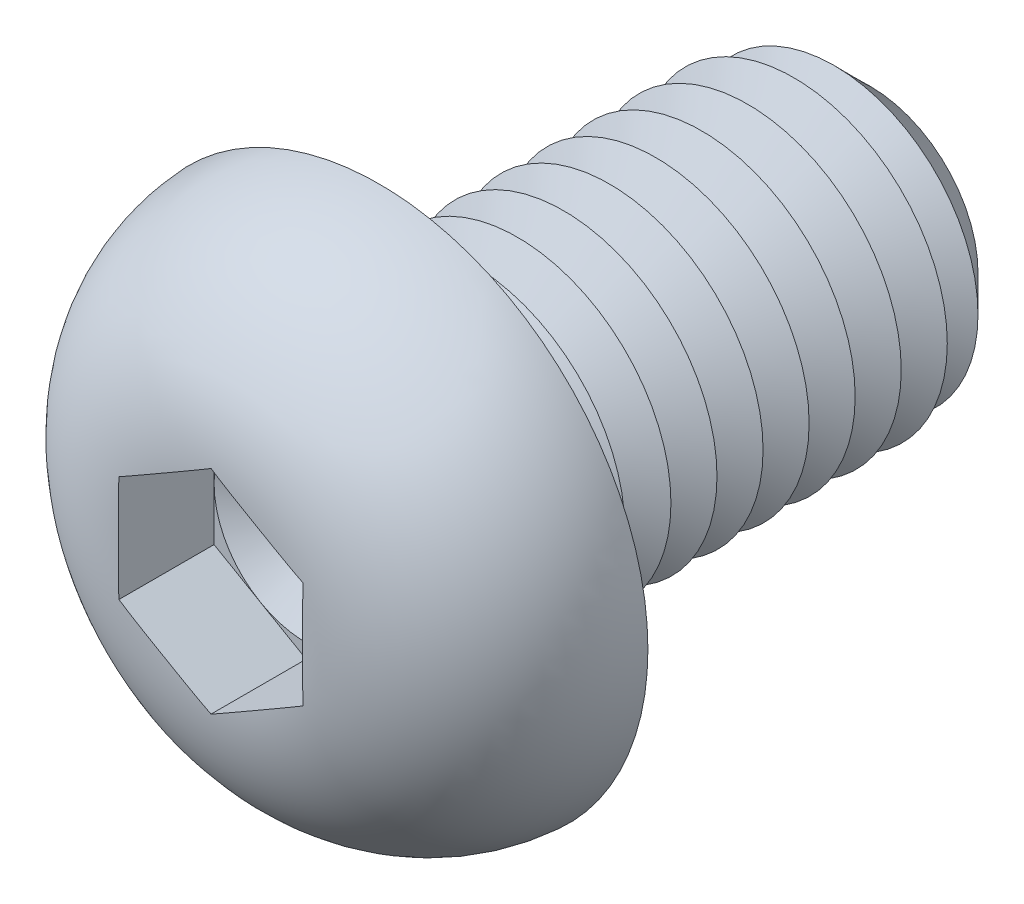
from build123d import *

# Parameters (mm, degrees)
CUT_EXTRUDE1_DEPTH  = 3.12
SKETCH4_R           = 5
BOSS_EXTRUDE1_DEPTH = 16
CHAMFER1_SIZE       = 1.5
LPATTERN1_COUNT     = 9
LPATTERN1_PITCH     = 1.5
FILLET2_R           = 0.6


with BuildPart() as part:
    # Sketch2 → Revolve1 (revolve)
    with BuildSketch(Plane(origin=(0, 0, 0), x_dir=(0, 0, -1), z_dir=(1, 0, 0)), mode=Mode.PRIVATE) as revolve1_sk:
        with BuildLine():
            Line((0, 0), (-5.5, 0))
            Line((-5.5, 0), (-5.5, 2.957763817))
            ThreePointArc((-5.5, 2.957763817), (-3.905948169, 6.951508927), (0, 8.75))
            Line((0, 8.75), (0, 0))
        make_face()
    revolve(revolve1_sk.sketch.rotate(Axis((0, 0, 47.934239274), (0, 0, -1)), 90), axis=Axis((0, 0, 47.934239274), (0, 0, -1)))

    # Sketch3 → Cut-Extrude1 (cut)
    with BuildSketch(Plane.XY.offset(5.5)):
        Polygon((0, 3.464101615), (-3, 1.732050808), (-3, -1.732050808), (0, -3.464101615), (3, -1.732050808), (3, 1.732050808), align=None)
    extrude(amount=-CUT_EXTRUDE1_DEPTH, mode=Mode.SUBTRACT)

    # Sketch4 → Boss-Extrude1 (add)
    with BuildSketch(Plane(origin=(0, 0, 0), x_dir=(-1, 0, 0), z_dir=(0, 0, -1))):
        with Locations(Location((0, 0, 0), (0, 0, 180))):
            Circle(SKETCH4_R)
    extrude(amount=BOSS_EXTRUDE1_DEPTH)

    # Chamfer1
    chamfer1_edges = [part.edges().sort_by_distance(p)[0] for p in [
        (-5, 0, -16),
    ]]
    chamfer(chamfer1_edges, length=CHAMFER1_SIZE)

    # Sketch5 → Cut-Revolve1 (revolve, cut)
    with BuildSketch(Plane(origin=(0, 0, 0), x_dir=(0, 0, -1), z_dir=(1, 0, 0)), mode=Mode.PRIVATE) as cut_revolve1_sk:
        Polygon((1.5, 5), (3, 5), (2.25, 3.700961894), align=None)
    cut_revolve1 = revolve(cut_revolve1_sk.sketch.rotate(Axis((0, 0, 47.934239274), (0, 0, -1)), 90), axis=Axis((0, 0, 47.934239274), (0, 0, -1)), mode=Mode.SUBTRACT)

    # LPattern1: Cut-Revolve1 ×9
    with Locations(*[(0, 0, -i * LPATTERN1_PITCH) for i in range(1, LPATTERN1_COUNT)]):
        add(cut_revolve1, mode=Mode.SUBTRACT)

    # Fillet2
    fillet2_edges = [part.edges().sort_by_distance(p)[0] for p in [
        (-5, 0, 0),
    ]]
    fillet(fillet2_edges, radius=FILLET2_R)

    # Cut-Extrude2 cone 1 section (on through the dimple's axis) → Cut-Extrude2 (revolve, cut)
    with BuildSketch(Plane(origin=(0, 0, 2.38), x_dir=(0, -1, 0), z_dir=(1, 0, 0))):
        Polygon((0, 0), (3, 0), (0, 1.732050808), align=None)
    revolve(axis=Axis((0, 0, 2.38), (0, 0, -1)), mode=Mode.SUBTRACT)


solid = part.part
